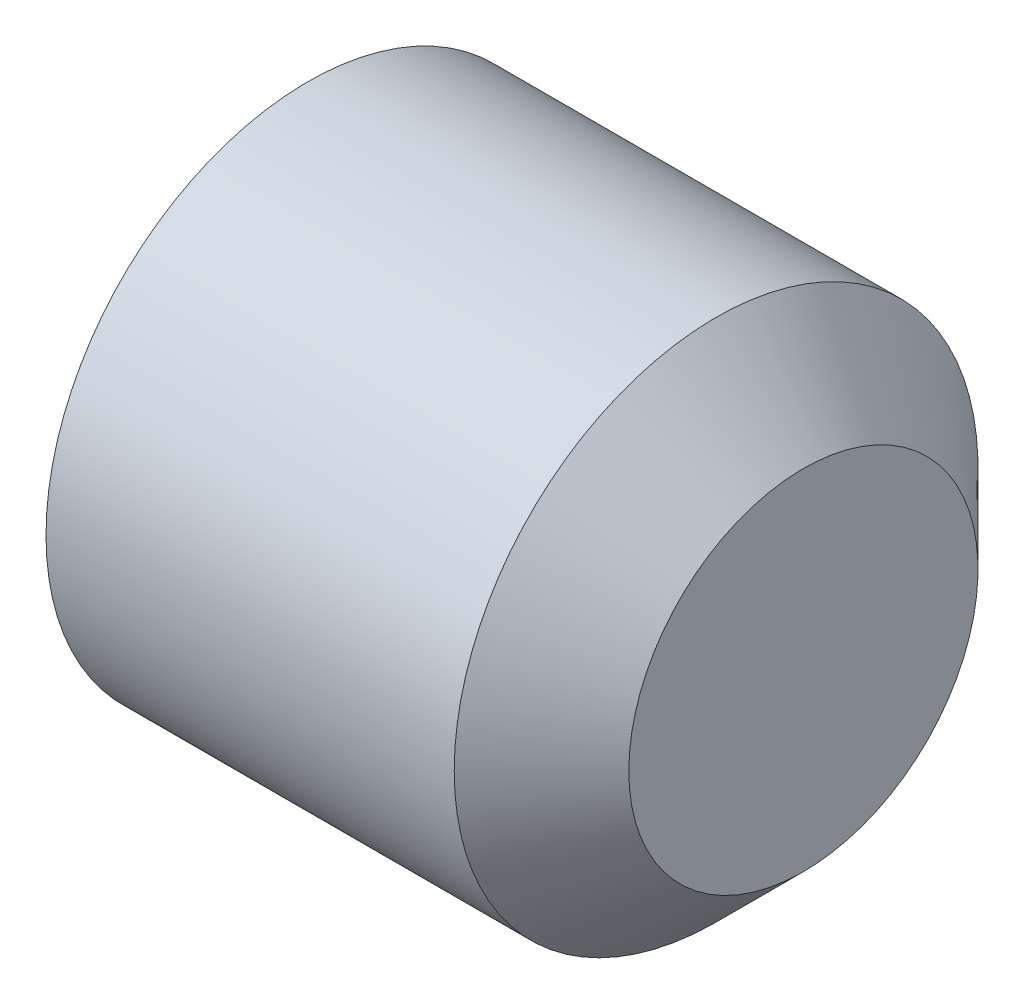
from build123d import *

# Parameters (mm, degrees)
HEX_2_DEPTH = 1.2


with BuildPart() as part:
    # BodySke → BaseBody (revolve)
    with BuildSketch(Plane.XY, mode=Mode.PRIVATE) as basebody_sk:
        Polygon((0, 0), (0, 1.2195), (0.161946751, 1.5), (2.5, 1.5), (3, 1), (3, 0), align=None)
    revolve(basebody_sk.sketch.rotate(Axis((-12.7, 0, 0), (1, 0, 0)), 90), axis=Axis((-12.7, 0, 0), (1, 0, 0)))

    # Sketch2 → Hex 2 (cut)
    with BuildSketch(Plane.ZY):
        Polygon((0.433012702, 0.75), (-0.433012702, 0.75), (-0.866025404, 0), (-0.433012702, -0.75), (0.433012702, -0.75), (0.866025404, 0), align=None)
    extrude(amount=-HEX_2_DEPTH, mode=Mode.SUBTRACT)


solid = part.part
